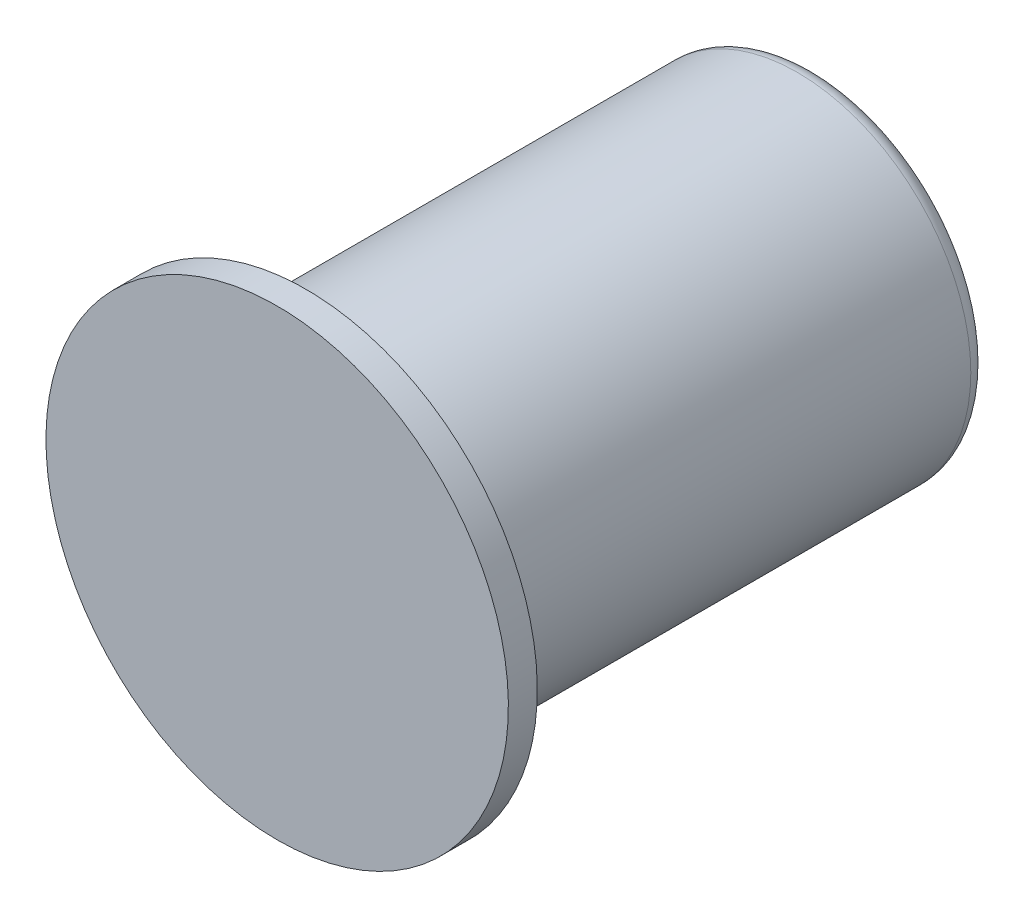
ISO-10303-21;
HEADER;
FILE_DESCRIPTION(('STEP AP214'),'2;1');
FILE_NAME('part.step','',(''),(''),'','','');
FILE_SCHEMA(('AUTOMOTIVE_DESIGN { 1 0 10303 214 1 1 1 1 }'));
ENDSEC;
DATA;
#1=APPLICATION_CONTEXT('core data for automotive mechanical design processes');
#2=APPLICATION_PROTOCOL_DEFINITION('international standard','automotive_design',2000,#1);
#3=PRODUCT_CONTEXT('',#1,'mechanical');
#4=PRODUCT('Part','Part','',(#3));
#5=PRODUCT_RELATED_PRODUCT_CATEGORY('part','',(#4));
#6=PRODUCT_DEFINITION_FORMATION('','',#4);
#7=PRODUCT_DEFINITION_CONTEXT('part definition',#1,'design');
#8=PRODUCT_DEFINITION('design','',#6,#7);
#9=PRODUCT_DEFINITION_SHAPE('','',#8);
#10=(LENGTH_UNIT() NAMED_UNIT(*) SI_UNIT(.MILLI.,.METRE.));
#11=(NAMED_UNIT(*) PLANE_ANGLE_UNIT() SI_UNIT($,.RADIAN.));
#12=(NAMED_UNIT(*) SI_UNIT($,.STERADIAN.) SOLID_ANGLE_UNIT());
#13=UNCERTAINTY_MEASURE_WITH_UNIT(LENGTH_MEASURE(1.E-05),#10,'distance_accuracy_value','');
#14=(GEOMETRIC_REPRESENTATION_CONTEXT(3) GLOBAL_UNCERTAINTY_ASSIGNED_CONTEXT((#13)) GLOBAL_UNIT_ASSIGNED_CONTEXT((#10,
#11,#12)) REPRESENTATION_CONTEXT('',''));
#15=CARTESIAN_POINT('',(0.,0.,0.));
#16=DIRECTION('',(0.,0.,1.));
#17=DIRECTION('',(1.,0.,0.));
#18=AXIS2_PLACEMENT_3D('',#15,#16,#17);
#19=CARTESIAN_POINT('',(0.,0.,0.));
#20=DIRECTION('',(0.,0.,-1.));
#21=DIRECTION('',(0.,1.,0.));
#22=AXIS2_PLACEMENT_3D('',#19,#20,#21);
#23=PLANE('',#22);
#24=CARTESIAN_POINT('',(0.,0.,0.));
#25=DIRECTION('',(0.,0.,1.));
#26=DIRECTION('',(0.,-1.,0.));
#27=AXIS2_PLACEMENT_3D('',#24,#25,#26);
#28=CIRCLE('',#27,40.);
#29=CARTESIAN_POINT('',(0.,-40.,0.));
#30=VERTEX_POINT('',#29);
#31=EDGE_CURVE('E11',#30,#30,#28,.T.);
#32=ORIENTED_EDGE('',*,*,#31,.T.);
#33=EDGE_LOOP('',(#32));
#34=FACE_BOUND('',#33,.T.);
#35=ADVANCED_FACE('F32',(#34),#23,.F.);
#36=CARTESIAN_POINT('',(0.,0.,0.));
#37=DIRECTION('',(0.,0.,1.));
#38=DIRECTION('',(0.,-1.,0.));
#39=AXIS2_PLACEMENT_3D('',#36,#37,#38);
#40=CYLINDRICAL_SURFACE('',#39,40.);
#41=ORIENTED_EDGE('',*,*,#31,.F.);
#42=EDGE_LOOP('',(#41));
#43=FACE_BOUND('',#42,.T.);
#44=CARTESIAN_POINT('',(0.,0.,-5.));
#45=DIRECTION('',(0.,0.,1.));
#46=DIRECTION('',(0.,-1.,0.));
#47=AXIS2_PLACEMENT_3D('',#44,#45,#46);
#48=CIRCLE('',#47,40.);
#49=CARTESIAN_POINT('',(0.,-40.,-5.));
#50=VERTEX_POINT('',#49);
#51=EDGE_CURVE('E38',#50,#50,#48,.T.);
#52=ORIENTED_EDGE('',*,*,#51,.T.);
#53=EDGE_LOOP('',(#52));
#54=FACE_BOUND('',#53,.T.);
#55=ADVANCED_FACE('F54',(#43,#54),#40,.T.);
#56=CARTESIAN_POINT('',(0.,40.,-5.));
#57=DIRECTION('',(0.,0.,1.));
#58=DIRECTION('',(0.,-1.,0.));
#59=AXIS2_PLACEMENT_3D('',#56,#57,#58);
#60=PLANE('',#59);
#61=ORIENTED_EDGE('',*,*,#51,.F.);
#62=EDGE_LOOP('',(#61));
#63=FACE_BOUND('',#62,.T.);
#64=CARTESIAN_POINT('',(0.,0.,-5.));
#65=DIRECTION('',(0.,0.,1.));
#66=DIRECTION('',(0.,-1.,0.));
#67=AXIS2_PLACEMENT_3D('',#64,#65,#66);
#68=CIRCLE('',#67,30.);
#69=CARTESIAN_POINT('',(0.,-30.,-5.));
#70=VERTEX_POINT('',#69);
#71=EDGE_CURVE('E66',#70,#70,#68,.T.);
#72=ORIENTED_EDGE('',*,*,#71,.T.);
#73=EDGE_LOOP('',(#72));
#74=FACE_BOUND('',#73,.T.);
#75=ADVANCED_FACE('F59',(#63,#74),#60,.F.);
#76=CARTESIAN_POINT('',(0.,0.,0.));
#77=DIRECTION('',(0.,0.,1.));
#78=DIRECTION('',(0.,-1.,0.));
#79=AXIS2_PLACEMENT_3D('',#76,#77,#78);
#80=CYLINDRICAL_SURFACE('',#79,30.);
#81=ORIENTED_EDGE('',*,*,#71,.F.);
#82=EDGE_LOOP('',(#81));
#83=FACE_BOUND('',#82,.T.);
#84=CARTESIAN_POINT('',(0.,0.,-90.));
#85=DIRECTION('',(0.,0.,1.));
#86=DIRECTION('',(0.,-1.,0.));
#87=AXIS2_PLACEMENT_3D('',#84,#85,#86);
#88=CIRCLE('',#87,30.);
#89=CARTESIAN_POINT('',(0.,-30.,-90.));
#90=VERTEX_POINT('',#89);
#91=EDGE_CURVE('E68',#90,#90,#88,.T.);
#92=ORIENTED_EDGE('',*,*,#91,.T.);
#93=EDGE_LOOP('',(#92));
#94=FACE_BOUND('',#93,.T.);
#95=ADVANCED_FACE('F101',(#83,#94),#80,.T.);
#96=CARTESIAN_POINT('',(0.,0.,-90.));
#97=DIRECTION('',(0.,0.,1.));
#98=DIRECTION('',(0.,-1.,0.));
#99=AXIS2_PLACEMENT_3D('',#96,#97,#98);
#100=TOROIDAL_SURFACE('',#99,27.,3.);
#101=ORIENTED_EDGE('',*,*,#91,.F.);
#102=EDGE_LOOP('',(#101));
#103=FACE_BOUND('',#102,.T.);
#104=CARTESIAN_POINT('',(0.,0.,-93.));
#105=DIRECTION('',(0.,0.,1.));
#106=DIRECTION('',(0.,-1.,0.));
#107=AXIS2_PLACEMENT_3D('',#104,#105,#106);
#108=CIRCLE('',#107,27.);
#109=CARTESIAN_POINT('',(0.,-27.,-93.));
#110=VERTEX_POINT('',#109);
#111=EDGE_CURVE('E73',#110,#110,#108,.T.);
#112=ORIENTED_EDGE('',*,*,#111,.T.);
#113=EDGE_LOOP('',(#112));
#114=FACE_BOUND('',#113,.T.);
#115=ADVANCED_FACE('F94',(#103,#114),#100,.T.);
#116=CARTESIAN_POINT('',(0.,27.,-93.));
#117=DIRECTION('',(0.,0.,1.));
#118=DIRECTION('',(0.,-1.,0.));
#119=AXIS2_PLACEMENT_3D('',#116,#117,#118);
#120=PLANE('',#119);
#121=ORIENTED_EDGE('',*,*,#111,.F.);
#122=EDGE_LOOP('',(#121));
#123=FACE_BOUND('',#122,.T.);
#124=CARTESIAN_POINT('',(0.,0.,-93.));
#125=DIRECTION('',(0.,0.,1.));
#126=DIRECTION('',(0.,-1.,0.));
#127=AXIS2_PLACEMENT_3D('',#124,#125,#126);
#128=CIRCLE('',#127,5.49999999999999);
#129=CARTESIAN_POINT('',(0.,-5.49999999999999,-93.));
#130=VERTEX_POINT('',#129);
#131=EDGE_CURVE('E76',#130,#130,#128,.T.);
#132=ORIENTED_EDGE('',*,*,#131,.T.);
#133=EDGE_LOOP('',(#132));
#134=FACE_BOUND('',#133,.T.);
#135=ADVANCED_FACE('F88',(#123,#134),#120,.F.);
#136=CARTESIAN_POINT('',(0.,0.,-92.5));
#137=DIRECTION('',(0.,0.,-1.));
#138=DIRECTION('',(0.,1.,0.));
#139=AXIS2_PLACEMENT_3D('',#136,#137,#138);
#140=CONICAL_SURFACE('',#139,5.,0.785398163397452);
#141=ORIENTED_EDGE('',*,*,#131,.F.);
#142=EDGE_LOOP('',(#141));
#143=FACE_BOUND('',#142,.T.);
#144=CARTESIAN_POINT('',(0.,0.,-92.5));
#145=DIRECTION('',(0.,0.,1.));
#146=DIRECTION('',(0.,-1.,0.));
#147=AXIS2_PLACEMENT_3D('',#144,#145,#146);
#148=CIRCLE('',#147,5.);
#149=CARTESIAN_POINT('',(0.,-5.,-92.5));
#150=VERTEX_POINT('',#149);
#151=EDGE_CURVE('E79',#150,#150,#148,.T.);
#152=ORIENTED_EDGE('',*,*,#151,.T.);
#153=EDGE_LOOP('',(#152));
#154=FACE_BOUND('',#153,.T.);
#155=ADVANCED_FACE('F49',(#143,#154),#140,.F.);
#156=CARTESIAN_POINT('',(0.,0.,0.));
#157=DIRECTION('',(0.,0.,1.));
#158=DIRECTION('',(0.,-1.,0.));
#159=AXIS2_PLACEMENT_3D('',#156,#157,#158);
#160=CYLINDRICAL_SURFACE('',#159,5.);
#161=ORIENTED_EDGE('',*,*,#151,.F.);
#162=EDGE_LOOP('',(#161));
#163=FACE_BOUND('',#162,.T.);
#164=CARTESIAN_POINT('',(0.,0.,-84.));
#165=DIRECTION('',(0.,0.,1.));
#166=DIRECTION('',(0.,-1.,0.));
#167=AXIS2_PLACEMENT_3D('',#164,#165,#166);
#168=CIRCLE('',#167,5.);
#169=CARTESIAN_POINT('',(0.,-5.,-84.));
#170=VERTEX_POINT('',#169);
#171=EDGE_CURVE('E82',#170,#170,#168,.T.);
#172=ORIENTED_EDGE('',*,*,#171,.T.);
#173=EDGE_LOOP('',(#172));
#174=FACE_BOUND('',#173,.T.);
#175=ADVANCED_FACE('F43',(#163,#174),#160,.F.);
#176=CARTESIAN_POINT('',(0.,0.,-81.1132486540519));
#177=DIRECTION('',(0.,0.,-1.));
#178=DIRECTION('',(0.,1.,0.));
#179=AXIS2_PLACEMENT_3D('',#176,#177,#178);
#180=CONICAL_SURFACE('',#179,0.,1.04719755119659);
#181=ORIENTED_EDGE('',*,*,#171,.F.);
#182=EDGE_LOOP('',(#181));
#183=FACE_BOUND('',#182,.T.);
#184=CARTESIAN_POINT('',(0.,0.,-81.1132486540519));
#185=VERTEX_POINT('',#184);
#186=VERTEX_LOOP('',#185);
#187=FACE_BOUND('',#186,.T.);
#188=ADVANCED_FACE('F41',(#183,#187),#180,.F.);
#189=CLOSED_SHELL('',(#35,#55,#75,#95,#115,#135,#155,#175,#188));
#190=MANIFOLD_SOLID_BREP('B2',#189);
#191=ADVANCED_BREP_SHAPE_REPRESENTATION('',(#18,#190),#14);
#192=SHAPE_DEFINITION_REPRESENTATION(#9,#191);
ENDSEC;
END-ISO-10303-21;
